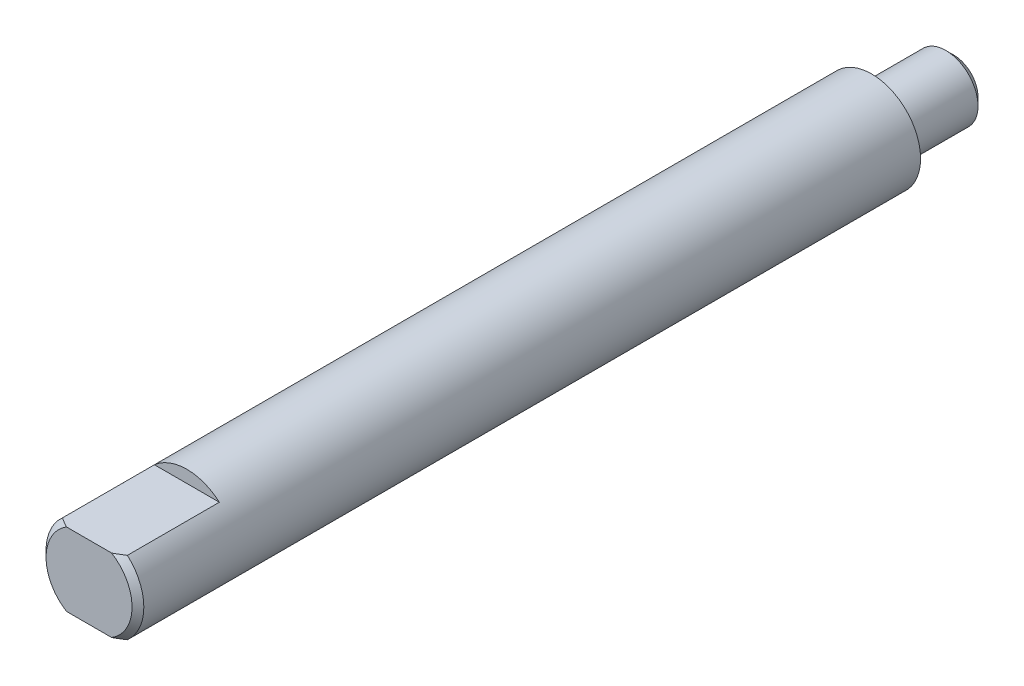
from build123d import *

# Parameters (mm, degrees)
SKETCH2_W          = 6.35
SKETCH2_H          = 0.8
CUT_EXTRUDE1_DEPTH = 5


with BuildPart() as part:
    # Sketch1 → Revolve1 (revolve)
    with BuildSketch(Plane(origin=(0, 0, 0), x_dir=(0, 0, -1), z_dir=(1, 0, 0)), mode=Mode.PRIVATE) as revolve1_sk:
        Polygon((52.066, 1.5728), (51.556, 2.0828), (46.736, 2.0828), (46.736, 3.175), (-3.684, 3.175), (-4.064, 2.79), (-4.064, 0), (52.066, 0), align=None)
    revolve(revolve1_sk.sketch.rotate(Axis((0, 0, 4.064), (0, 0, -1)), 90), axis=Axis((0, 0, 4.064), (0, 0, -1)))

    # Sketch2 → Cut-Extrude1 (cut, symmetric)
    with BuildSketch(Plane(origin=(0, 0, 0), x_dir=(0, 0, -1), z_dir=(1, 0, 0))):
        with Locations((-0.889, 2.775)):
            Rectangle(SKETCH2_W, SKETCH2_H)
        with Locations((-0.889, -2.775)):
            Rectangle(SKETCH2_W, SKETCH2_H)
    extrude(amount=CUT_EXTRUDE1_DEPTH, both=True, mode=Mode.SUBTRACT)


solid = part.part
